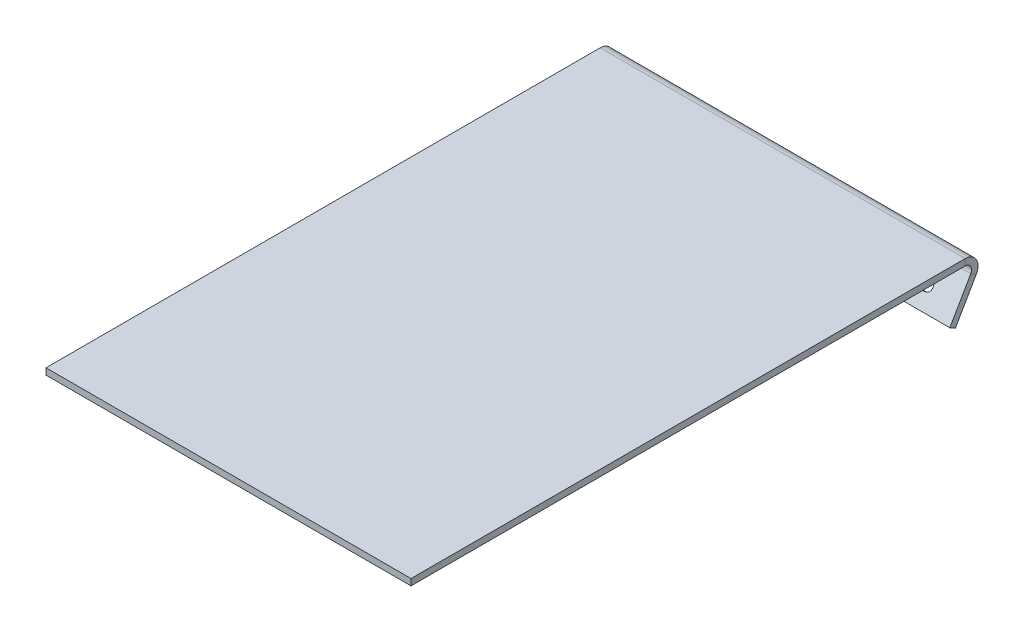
ISO-10303-21;
HEADER;
FILE_DESCRIPTION(('STEP AP214'),'2;1');
FILE_NAME('part.step','',(''),(''),'','','');
FILE_SCHEMA(('AUTOMOTIVE_DESIGN { 1 0 10303 214 1 1 1 1 }'));
ENDSEC;
DATA;
#1=APPLICATION_CONTEXT('core data for automotive mechanical design processes');
#2=APPLICATION_PROTOCOL_DEFINITION('international standard','automotive_design',2000,#1);
#3=PRODUCT_CONTEXT('',#1,'mechanical');
#4=PRODUCT('Part','Part','',(#3));
#5=PRODUCT_RELATED_PRODUCT_CATEGORY('part','',(#4));
#6=PRODUCT_DEFINITION_FORMATION('','',#4);
#7=PRODUCT_DEFINITION_CONTEXT('part definition',#1,'design');
#8=PRODUCT_DEFINITION('design','',#6,#7);
#9=PRODUCT_DEFINITION_SHAPE('','',#8);
#10=(LENGTH_UNIT() NAMED_UNIT(*) SI_UNIT(.MILLI.,.METRE.));
#11=(NAMED_UNIT(*) PLANE_ANGLE_UNIT() SI_UNIT($,.RADIAN.));
#12=(NAMED_UNIT(*) SI_UNIT($,.STERADIAN.) SOLID_ANGLE_UNIT());
#13=UNCERTAINTY_MEASURE_WITH_UNIT(LENGTH_MEASURE(1.E-05),#10,'distance_accuracy_value','');
#14=(GEOMETRIC_REPRESENTATION_CONTEXT(3) GLOBAL_UNCERTAINTY_ASSIGNED_CONTEXT((#13)) GLOBAL_UNIT_ASSIGNED_CONTEXT((#10,
#11,#12)) REPRESENTATION_CONTEXT('',''));
#15=CARTESIAN_POINT('',(0.,0.,0.));
#16=DIRECTION('',(0.,0.,1.));
#17=DIRECTION('',(1.,0.,0.));
#18=AXIS2_PLACEMENT_3D('',#15,#16,#17);
#19=CARTESIAN_POINT('',(57.,1.00000000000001,-178.267949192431));
#20=DIRECTION('',(0.,-0.500000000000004,-0.866025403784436));
#21=DIRECTION('',(0.,0.866025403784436,-0.500000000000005));
#22=AXIS2_PLACEMENT_3D('',#19,#20,#21);
#23=PLANE('',#22);
#24=CARTESIAN_POINT('',(-47.,-11.1243556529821,-171.267949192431));
#25=DIRECTION('',(0.,-0.500000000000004,-0.866025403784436));
#26=DIRECTION('',(0.,0.866025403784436,-0.500000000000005));
#27=AXIS2_PLACEMENT_3D('',#24,#25,#26);
#28=CIRCLE('',#27,1.69999999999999);
#29=CARTESIAN_POINT('',(-47.,-9.65211246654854,-172.117949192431));
#30=VERTEX_POINT('',#29);
#31=EDGE_CURVE('E142',#30,#30,#28,.F.);
#32=ORIENTED_EDGE('',*,*,#31,.F.);
#33=EDGE_LOOP('',(#32));
#34=FACE_BOUND('',#33,.T.);
#35=DIRECTION('',(0.,-0.866025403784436,0.500000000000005));
#36=VECTOR('',#35,1.);
#37=CARTESIAN_POINT('',(-57.,1.00000000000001,-178.267949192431));
#38=LINE('',#37,#36);
#39=CARTESIAN_POINT('',(-57.,-5.00000000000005,-174.803847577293));
#40=VERTEX_POINT('',#39);
#41=CARTESIAN_POINT('',(-57.,-16.3205080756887,-168.267949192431));
#42=VERTEX_POINT('',#41);
#43=EDGE_CURVE('E138',#40,#42,#38,.T.);
#44=ORIENTED_EDGE('',*,*,#43,.T.);
#45=DIRECTION('',(-1.,0.,0.));
#46=VECTOR('',#45,1.);
#47=CARTESIAN_POINT('',(57.,-16.3205080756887,-168.267949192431));
#48=LINE('',#47,#46);
#49=CARTESIAN_POINT('',(57.,-16.3205080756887,-168.267949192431));
#50=VERTEX_POINT('',#49);
#51=EDGE_CURVE('E169',#50,#42,#48,.T.);
#52=ORIENTED_EDGE('',*,*,#51,.F.);
#53=DIRECTION('',(0.,-0.866025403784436,0.500000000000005));
#54=VECTOR('',#53,1.);
#55=CARTESIAN_POINT('',(57.,1.00000000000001,-178.267949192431));
#56=LINE('',#55,#54);
#57=CARTESIAN_POINT('',(57.,-5.00000000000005,-174.803847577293));
#58=VERTEX_POINT('',#57);
#59=EDGE_CURVE('E91',#58,#50,#56,.T.);
#60=ORIENTED_EDGE('',*,*,#59,.F.);
#61=DIRECTION('',(-1.,0.,0.));
#62=VECTOR('',#61,1.);
#63=CARTESIAN_POINT('',(57.,-5.00000000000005,-174.803847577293));
#64=LINE('',#63,#62);
#65=EDGE_CURVE('E137',#58,#40,#64,.T.);
#66=ORIENTED_EDGE('',*,*,#65,.T.);
#67=EDGE_LOOP('',(#44,#52,#60,#66));
#68=FACE_BOUND('',#67,.T.);
#69=CARTESIAN_POINT('',(47.,-11.1243556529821,-171.267949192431));
#70=DIRECTION('',(0.,-0.500000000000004,-0.866025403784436));
#71=DIRECTION('',(0.,0.866025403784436,-0.500000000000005));
#72=AXIS2_PLACEMENT_3D('',#69,#70,#71);
#73=CIRCLE('',#72,1.69999999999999);
#74=CARTESIAN_POINT('',(47.,-9.65211246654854,-172.117949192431));
#75=VERTEX_POINT('',#74);
#76=EDGE_CURVE('E255',#75,#75,#73,.F.);
#77=ORIENTED_EDGE('',*,*,#76,.F.);
#78=EDGE_LOOP('',(#77));
#79=FACE_BOUND('',#78,.T.);
#80=ADVANCED_FACE('F34',(#34,#68,#79),#23,.F.);
#81=CARTESIAN_POINT('',(57.,-6.00000000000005,-176.535898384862));
#82=DIRECTION('',(1.,0.,0.));
#83=DIRECTION('',(0.,0.,-1.));
#84=AXIS2_PLACEMENT_3D('',#81,#82,#83);
#85=PLANE('',#84);
#86=DIRECTION('',(0.,0.5,0.866025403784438));
#87=VECTOR('',#86,1.);
#88=CARTESIAN_POINT('',(57.,-6.00000000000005,-176.535898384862));
#89=LINE('',#88,#87);
#90=CARTESIAN_POINT('',(57.,-6.00000000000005,-176.535898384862));
#91=VERTEX_POINT('',#90);
#92=EDGE_CURVE('E11',#91,#58,#89,.T.);
#93=ORIENTED_EDGE('',*,*,#92,.F.);
#94=CARTESIAN_POINT('',(57.,-4.00000000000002,-173.071796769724));
#95=DIRECTION('',(1.,0.,0.));
#96=DIRECTION('',(0.,0.,-1.));
#97=AXIS2_PLACEMENT_3D('',#94,#95,#96);
#98=CIRCLE('',#97,4.);
#99=CARTESIAN_POINT('',(57.,0.,-173.071796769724));
#100=VERTEX_POINT('',#99);
#101=EDGE_CURVE('E132',#100,#91,#98,.F.);
#102=ORIENTED_EDGE('',*,*,#101,.F.);
#103=DIRECTION('',(0.,1.,0.));
#104=VECTOR('',#103,1.);
#105=CARTESIAN_POINT('',(57.,-2.00000000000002,-173.071796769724));
#106=LINE('',#105,#104);
#107=CARTESIAN_POINT('',(57.,-2.00000000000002,-173.071796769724));
#108=VERTEX_POINT('',#107);
#109=EDGE_CURVE('E43',#108,#100,#106,.T.);
#110=ORIENTED_EDGE('',*,*,#109,.F.);
#111=CARTESIAN_POINT('',(57.,-4.00000000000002,-173.071796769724));
#112=DIRECTION('',(1.,0.,0.));
#113=DIRECTION('',(0.,0.,-1.));
#114=AXIS2_PLACEMENT_3D('',#111,#112,#113);
#115=CIRCLE('',#114,2.);
#116=EDGE_CURVE('E125',#108,#58,#115,.F.);
#117=ORIENTED_EDGE('',*,*,#116,.T.);
#118=EDGE_LOOP('',(#93,#102,#110,#117));
#119=FACE_BOUND('',#118,.T.);
#120=ADVANCED_FACE('F36',(#119),#85,.T.);
#121=CARTESIAN_POINT('',(57.,-2.00000000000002,-173.071796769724));
#122=DIRECTION('',(1.,0.,0.));
#123=DIRECTION('',(0.,0.,-1.));
#124=AXIS2_PLACEMENT_3D('',#121,#122,#123);
#125=PLANE('',#124);
#126=DIRECTION('',(0.,-0.866025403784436,0.500000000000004));
#127=VECTOR('',#126,1.);
#128=CARTESIAN_POINT('',(57.,0.,-180.));
#129=LINE('',#128,#127);
#130=CARTESIAN_POINT('',(57.,-17.3205080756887,-170.));
#131=VERTEX_POINT('',#130);
#132=EDGE_CURVE('E182',#91,#131,#129,.T.);
#133=ORIENTED_EDGE('',*,*,#132,.F.);
#134=ORIENTED_EDGE('',*,*,#92,.T.);
#135=ORIENTED_EDGE('',*,*,#59,.T.);
#136=DIRECTION('',(0.,0.499999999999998,0.866025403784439));
#137=VECTOR('',#136,1.);
#138=CARTESIAN_POINT('',(57.,-17.3205080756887,-170.));
#139=LINE('',#138,#137);
#140=EDGE_CURVE('E268',#131,#50,#139,.T.);
#141=ORIENTED_EDGE('',*,*,#140,.F.);
#142=EDGE_LOOP('',(#133,#134,#135,#141));
#143=FACE_BOUND('',#142,.T.);
#144=ADVANCED_FACE('F190',(#143),#125,.T.);
#145=CARTESIAN_POINT('',(-57.,0.,-173.071796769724));
#146=DIRECTION('',(-1.,0.,0.));
#147=DIRECTION('',(0.,0.,1.));
#148=AXIS2_PLACEMENT_3D('',#145,#146,#147);
#149=PLANE('',#148);
#150=DIRECTION('',(0.,-1.,0.));
#151=VECTOR('',#150,1.);
#152=CARTESIAN_POINT('',(-57.,0.,-173.071796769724));
#153=LINE('',#152,#151);
#154=CARTESIAN_POINT('',(-57.,0.,-173.071796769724));
#155=VERTEX_POINT('',#154);
#156=CARTESIAN_POINT('',(-57.,-2.00000000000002,-173.071796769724));
#157=VERTEX_POINT('',#156);
#158=EDGE_CURVE('E78',#155,#157,#153,.T.);
#159=ORIENTED_EDGE('',*,*,#158,.F.);
#160=CARTESIAN_POINT('',(-57.,-4.00000000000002,-173.071796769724));
#161=DIRECTION('',(1.,0.,0.));
#162=DIRECTION('',(0.,0.,-1.));
#163=AXIS2_PLACEMENT_3D('',#160,#161,#162);
#164=CIRCLE('',#163,4.);
#165=CARTESIAN_POINT('',(-57.,-6.00000000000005,-176.535898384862));
#166=VERTEX_POINT('',#165);
#167=EDGE_CURVE('E148',#155,#166,#164,.F.);
#168=ORIENTED_EDGE('',*,*,#167,.T.);
#169=DIRECTION('',(0.,-0.5,-0.866025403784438));
#170=VECTOR('',#169,1.);
#171=CARTESIAN_POINT('',(-57.,-5.00000000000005,-174.803847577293));
#172=LINE('',#171,#170);
#173=EDGE_CURVE('E85',#40,#166,#172,.T.);
#174=ORIENTED_EDGE('',*,*,#173,.F.);
#175=CARTESIAN_POINT('',(-57.,-4.00000000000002,-173.071796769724));
#176=DIRECTION('',(1.,0.,0.));
#177=DIRECTION('',(0.,0.,-1.));
#178=AXIS2_PLACEMENT_3D('',#175,#176,#177);
#179=CIRCLE('',#178,2.);
#180=EDGE_CURVE('E155',#157,#40,#179,.F.);
#181=ORIENTED_EDGE('',*,*,#180,.F.);
#182=EDGE_LOOP('',(#159,#168,#174,#181));
#183=FACE_BOUND('',#182,.T.);
#184=ADVANCED_FACE('F188',(#183),#149,.T.);
#185=CARTESIAN_POINT('',(-57.,-5.00000000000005,-174.803847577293));
#186=DIRECTION('',(-1.,0.,0.));
#187=DIRECTION('',(0.,0.,1.));
#188=AXIS2_PLACEMENT_3D('',#185,#186,#187);
#189=PLANE('',#188);
#190=DIRECTION('',(0.,0.,-1.));
#191=VECTOR('',#190,1.);
#192=CARTESIAN_POINT('',(-57.,0.,0.));
#193=LINE('',#192,#191);
#194=CARTESIAN_POINT('',(-57.,0.,0.));
#195=VERTEX_POINT('',#194);
#196=EDGE_CURVE('E150',#195,#155,#193,.T.);
#197=ORIENTED_EDGE('',*,*,#196,.T.);
#198=ORIENTED_EDGE('',*,*,#158,.T.);
#199=DIRECTION('',(0.,0.,-1.));
#200=VECTOR('',#199,1.);
#201=CARTESIAN_POINT('',(-57.,-2.,0.));
#202=LINE('',#201,#200);
#203=CARTESIAN_POINT('',(-57.,-2.,0.));
#204=VERTEX_POINT('',#203);
#205=EDGE_CURVE('E153',#204,#157,#202,.T.);
#206=ORIENTED_EDGE('',*,*,#205,.F.);
#207=DIRECTION('',(0.,1.,0.));
#208=VECTOR('',#207,1.);
#209=CARTESIAN_POINT('',(-57.,-2.,0.));
#210=LINE('',#209,#208);
#211=EDGE_CURVE('E113',#204,#195,#210,.T.);
#212=ORIENTED_EDGE('',*,*,#211,.T.);
#213=EDGE_LOOP('',(#197,#198,#206,#212));
#214=FACE_BOUND('',#213,.T.);
#215=ADVANCED_FACE('F184',(#214),#189,.T.);
#216=CARTESIAN_POINT('',(57.,-17.3205080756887,-170.));
#217=DIRECTION('',(0.,-0.866025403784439,0.499999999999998));
#218=DIRECTION('',(0.,-0.499999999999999,-0.86602540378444));
#219=AXIS2_PLACEMENT_3D('',#216,#217,#218);
#220=PLANE('',#219);
#221=DIRECTION('',(0.,0.499999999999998,0.866025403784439));
#222=VECTOR('',#221,1.);
#223=CARTESIAN_POINT('',(-57.,-17.3205080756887,-170.));
#224=LINE('',#223,#222);
#225=CARTESIAN_POINT('',(-57.,-17.3205080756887,-170.));
#226=VERTEX_POINT('',#225);
#227=EDGE_CURVE('E141',#226,#42,#224,.T.);
#228=ORIENTED_EDGE('',*,*,#227,.F.);
#229=DIRECTION('',(-1.,0.,0.));
#230=VECTOR('',#229,1.);
#231=CARTESIAN_POINT('',(57.,-17.3205080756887,-170.));
#232=LINE('',#231,#230);
#233=EDGE_CURVE('E167',#131,#226,#232,.T.);
#234=ORIENTED_EDGE('',*,*,#233,.F.);
#235=ORIENTED_EDGE('',*,*,#140,.T.);
#236=ORIENTED_EDGE('',*,*,#51,.T.);
#237=EDGE_LOOP('',(#228,#234,#235,#236));
#238=FACE_BOUND('',#237,.T.);
#239=ADVANCED_FACE('F196',(#238),#220,.T.);
#240=CARTESIAN_POINT('',(57.,0.,-180.));
#241=DIRECTION('',(0.,-0.500000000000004,-0.866025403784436));
#242=DIRECTION('',(0.,0.866025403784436,-0.500000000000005));
#243=AXIS2_PLACEMENT_3D('',#240,#241,#242);
#244=PLANE('',#243);
#245=CARTESIAN_POINT('',(47.,-12.1243556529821,-173.));
#246=DIRECTION('',(0.,-0.500000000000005,-0.866025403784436));
#247=DIRECTION('',(0.,0.866025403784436,-0.500000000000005));
#248=AXIS2_PLACEMENT_3D('',#245,#246,#247);
#249=CIRCLE('',#248,3.36);
#250=CARTESIAN_POINT('',(47.,-9.21451029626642,-174.68));
#251=VERTEX_POINT('',#250);
#252=EDGE_CURVE('E253',#251,#251,#249,.T.);
#253=ORIENTED_EDGE('',*,*,#252,.F.);
#254=EDGE_LOOP('',(#253));
#255=FACE_BOUND('',#254,.T.);
#256=CARTESIAN_POINT('',(-47.,-12.1243556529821,-173.));
#257=DIRECTION('',(0.,-0.500000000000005,-0.866025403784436));
#258=DIRECTION('',(0.,0.866025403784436,-0.500000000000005));
#259=AXIS2_PLACEMENT_3D('',#256,#257,#258);
#260=CIRCLE('',#259,3.36);
#261=CARTESIAN_POINT('',(-47.,-9.21451029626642,-174.68));
#262=VERTEX_POINT('',#261);
#263=EDGE_CURVE('E262',#262,#262,#260,.T.);
#264=ORIENTED_EDGE('',*,*,#263,.F.);
#265=EDGE_LOOP('',(#264));
#266=FACE_BOUND('',#265,.T.);
#267=DIRECTION('',(0.,-0.866025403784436,0.500000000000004));
#268=VECTOR('',#267,1.);
#269=CARTESIAN_POINT('',(-57.,0.,-180.));
#270=LINE('',#269,#268);
#271=EDGE_CURVE('E145',#166,#226,#270,.T.);
#272=ORIENTED_EDGE('',*,*,#271,.F.);
#273=DIRECTION('',(-1.,0.,0.));
#274=VECTOR('',#273,1.);
#275=CARTESIAN_POINT('',(57.,-6.00000000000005,-176.535898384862));
#276=LINE('',#275,#274);
#277=EDGE_CURVE('E164',#91,#166,#276,.T.);
#278=ORIENTED_EDGE('',*,*,#277,.F.);
#279=ORIENTED_EDGE('',*,*,#132,.T.);
#280=ORIENTED_EDGE('',*,*,#233,.T.);
#281=EDGE_LOOP('',(#272,#278,#279,#280));
#282=FACE_BOUND('',#281,.T.);
#283=ADVANCED_FACE('F209',(#255,#266,#282),#244,.T.);
#284=CARTESIAN_POINT('',(57.,-4.00000000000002,-173.071796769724));
#285=DIRECTION('',(-1.,0.,0.));
#286=DIRECTION('',(0.,0.,1.));
#287=AXIS2_PLACEMENT_3D('',#284,#285,#286);
#288=CYLINDRICAL_SURFACE('',#287,4.);
#289=ORIENTED_EDGE('',*,*,#167,.F.);
#290=DIRECTION('',(-1.,0.,0.));
#291=VECTOR('',#290,1.);
#292=CARTESIAN_POINT('',(57.,0.,-173.071796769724));
#293=LINE('',#292,#291);
#294=EDGE_CURVE('E161',#100,#155,#293,.T.);
#295=ORIENTED_EDGE('',*,*,#294,.F.);
#296=ORIENTED_EDGE('',*,*,#101,.T.);
#297=ORIENTED_EDGE('',*,*,#277,.T.);
#298=EDGE_LOOP('',(#289,#295,#296,#297));
#299=FACE_BOUND('',#298,.T.);
#300=ADVANCED_FACE('F178',(#299),#288,.T.);
#301=CARTESIAN_POINT('',(57.,0.,0.));
#302=DIRECTION('',(0.,1.,0.));
#303=DIRECTION('',(0.,0.,1.));
#304=AXIS2_PLACEMENT_3D('',#301,#302,#303);
#305=PLANE('',#304);
#306=ORIENTED_EDGE('',*,*,#196,.F.);
#307=DIRECTION('',(-1.,0.,0.));
#308=VECTOR('',#307,1.);
#309=CARTESIAN_POINT('',(57.,0.,0.));
#310=LINE('',#309,#308);
#311=CARTESIAN_POINT('',(57.,0.,0.));
#312=VERTEX_POINT('',#311);
#313=EDGE_CURVE('E115',#312,#195,#310,.T.);
#314=ORIENTED_EDGE('',*,*,#313,.F.);
#315=DIRECTION('',(0.,0.,-1.));
#316=VECTOR('',#315,1.);
#317=CARTESIAN_POINT('',(57.,0.,0.));
#318=LINE('',#317,#316);
#319=EDGE_CURVE('E130',#312,#100,#318,.T.);
#320=ORIENTED_EDGE('',*,*,#319,.T.);
#321=ORIENTED_EDGE('',*,*,#294,.T.);
#322=EDGE_LOOP('',(#306,#314,#320,#321));
#323=FACE_BOUND('',#322,.T.);
#324=ADVANCED_FACE('F183',(#323),#305,.T.);
#325=CARTESIAN_POINT('',(57.,-2.,0.));
#326=DIRECTION('',(0.,0.,1.));
#327=DIRECTION('',(1.,0.,0.));
#328=AXIS2_PLACEMENT_3D('',#325,#326,#327);
#329=PLANE('',#328);
#330=ORIENTED_EDGE('',*,*,#211,.F.);
#331=DIRECTION('',(-1.,0.,0.));
#332=VECTOR('',#331,1.);
#333=CARTESIAN_POINT('',(57.,-2.,0.));
#334=LINE('',#333,#332);
#335=CARTESIAN_POINT('',(57.,-2.,0.));
#336=VERTEX_POINT('',#335);
#337=EDGE_CURVE('E107',#336,#204,#334,.T.);
#338=ORIENTED_EDGE('',*,*,#337,.F.);
#339=DIRECTION('',(0.,1.,0.));
#340=VECTOR('',#339,1.);
#341=CARTESIAN_POINT('',(57.,-2.,0.));
#342=LINE('',#341,#340);
#343=EDGE_CURVE('E111',#336,#312,#342,.T.);
#344=ORIENTED_EDGE('',*,*,#343,.T.);
#345=ORIENTED_EDGE('',*,*,#313,.T.);
#346=EDGE_LOOP('',(#330,#338,#344,#345));
#347=FACE_BOUND('',#346,.T.);
#348=ADVANCED_FACE('F109',(#347),#329,.T.);
#349=CARTESIAN_POINT('',(57.,-2.,0.));
#350=DIRECTION('',(0.,1.,0.));
#351=DIRECTION('',(0.,0.,1.));
#352=AXIS2_PLACEMENT_3D('',#349,#350,#351);
#353=PLANE('',#352);
#354=ORIENTED_EDGE('',*,*,#205,.T.);
#355=DIRECTION('',(-1.,0.,0.));
#356=VECTOR('',#355,1.);
#357=CARTESIAN_POINT('',(57.,-2.00000000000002,-173.071796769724));
#358=LINE('',#357,#356);
#359=EDGE_CURVE('E116',#108,#157,#358,.T.);
#360=ORIENTED_EDGE('',*,*,#359,.F.);
#361=DIRECTION('',(0.,0.,-1.));
#362=VECTOR('',#361,1.);
#363=CARTESIAN_POINT('',(57.,-2.,0.));
#364=LINE('',#363,#362);
#365=EDGE_CURVE('E120',#336,#108,#364,.T.);
#366=ORIENTED_EDGE('',*,*,#365,.F.);
#367=ORIENTED_EDGE('',*,*,#337,.T.);
#368=EDGE_LOOP('',(#354,#360,#366,#367));
#369=FACE_BOUND('',#368,.T.);
#370=ADVANCED_FACE('F121',(#369),#353,.F.);
#371=CARTESIAN_POINT('',(57.,-4.00000000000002,-173.071796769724));
#372=DIRECTION('',(-1.,0.,0.));
#373=DIRECTION('',(0.,0.,1.));
#374=AXIS2_PLACEMENT_3D('',#371,#372,#373);
#375=CYLINDRICAL_SURFACE('',#374,2.);
#376=ORIENTED_EDGE('',*,*,#180,.T.);
#377=ORIENTED_EDGE('',*,*,#65,.F.);
#378=ORIENTED_EDGE('',*,*,#116,.F.);
#379=ORIENTED_EDGE('',*,*,#359,.T.);
#380=EDGE_LOOP('',(#376,#377,#378,#379));
#381=FACE_BOUND('',#380,.T.);
#382=ADVANCED_FACE('F186',(#381),#375,.F.);
#383=CARTESIAN_POINT('',(57.,-4.00000000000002,-173.071796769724));
#384=DIRECTION('',(1.,0.,0.));
#385=DIRECTION('',(0.,0.,-1.));
#386=AXIS2_PLACEMENT_3D('',#383,#384,#385);
#387=PLANE('',#386);
#388=ORIENTED_EDGE('',*,*,#365,.T.);
#389=ORIENTED_EDGE('',*,*,#109,.T.);
#390=ORIENTED_EDGE('',*,*,#319,.F.);
#391=ORIENTED_EDGE('',*,*,#343,.F.);
#392=EDGE_LOOP('',(#388,#389,#390,#391));
#393=FACE_BOUND('',#392,.T.);
#394=ADVANCED_FACE('F128',(#393),#387,.T.);
#395=CARTESIAN_POINT('',(-57.,-4.00000000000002,-173.071796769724));
#396=DIRECTION('',(1.,0.,0.));
#397=DIRECTION('',(0.,0.,-1.));
#398=AXIS2_PLACEMENT_3D('',#395,#396,#397);
#399=PLANE('',#398);
#400=ORIENTED_EDGE('',*,*,#43,.F.);
#401=ORIENTED_EDGE('',*,*,#173,.T.);
#402=ORIENTED_EDGE('',*,*,#271,.T.);
#403=ORIENTED_EDGE('',*,*,#227,.T.);
#404=EDGE_LOOP('',(#400,#401,#402,#403));
#405=FACE_BOUND('',#404,.T.);
#406=ADVANCED_FACE('F224',(#405),#399,.F.);
#407=CARTESIAN_POINT('',(-47.,-12.1243556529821,-173.));
#408=DIRECTION('',(0.,-0.500000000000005,-0.866025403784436));
#409=DIRECTION('',(0.,0.866025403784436,-0.500000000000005));
#410=AXIS2_PLACEMENT_3D('',#407,#408,#409);
#411=CYLINDRICAL_SURFACE('',#410,1.69999999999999);
#412=ORIENTED_EDGE('',*,*,#31,.T.);
#413=EDGE_LOOP('',(#412));
#414=FACE_BOUND('',#413,.T.);
#415=CARTESIAN_POINT('',(-47.,-11.2943556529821,-171.562397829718));
#416=DIRECTION('',(0.,-0.500000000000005,-0.866025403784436));
#417=DIRECTION('',(0.,0.866025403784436,-0.500000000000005));
#418=AXIS2_PLACEMENT_3D('',#415,#416,#417);
#419=CIRCLE('',#418,1.69999999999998);
#420=CARTESIAN_POINT('',(-47.,-9.8221124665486,-172.412397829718));
#421=VERTEX_POINT('',#420);
#422=EDGE_CURVE('E261',#421,#421,#419,.T.);
#423=ORIENTED_EDGE('',*,*,#422,.T.);
#424=EDGE_LOOP('',(#423));
#425=FACE_BOUND('',#424,.T.);
#426=ADVANCED_FACE('F227',(#414,#425),#411,.F.);
#427=CARTESIAN_POINT('',(-47.,-12.1243556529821,-173.));
#428=DIRECTION('',(0.,-0.500000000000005,-0.866025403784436));
#429=DIRECTION('',(0.,0.866025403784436,-0.500000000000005));
#430=AXIS2_PLACEMENT_3D('',#427,#428,#429);
#431=CONICAL_SURFACE('',#430,3.36,0.785398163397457);
#432=ORIENTED_EDGE('',*,*,#422,.F.);
#433=EDGE_LOOP('',(#432));
#434=FACE_BOUND('',#433,.T.);
#435=ORIENTED_EDGE('',*,*,#263,.T.);
#436=EDGE_LOOP('',(#435));
#437=FACE_BOUND('',#436,.T.);
#438=ADVANCED_FACE('F233',(#434,#437),#431,.F.);
#439=CARTESIAN_POINT('',(47.,-12.1243556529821,-173.));
#440=DIRECTION('',(0.,-0.500000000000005,-0.866025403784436));
#441=DIRECTION('',(0.,0.866025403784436,-0.500000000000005));
#442=AXIS2_PLACEMENT_3D('',#439,#440,#441);
#443=CYLINDRICAL_SURFACE('',#442,1.69999999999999);
#444=ORIENTED_EDGE('',*,*,#76,.T.);
#445=EDGE_LOOP('',(#444));
#446=FACE_BOUND('',#445,.T.);
#447=CARTESIAN_POINT('',(47.,-11.2943556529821,-171.562397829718));
#448=DIRECTION('',(0.,-0.500000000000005,-0.866025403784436));
#449=DIRECTION('',(0.,0.866025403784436,-0.500000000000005));
#450=AXIS2_PLACEMENT_3D('',#447,#448,#449);
#451=CIRCLE('',#450,1.69999999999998);
#452=CARTESIAN_POINT('',(47.,-9.8221124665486,-172.412397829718));
#453=VERTEX_POINT('',#452);
#454=EDGE_CURVE('E250',#453,#453,#451,.T.);
#455=ORIENTED_EDGE('',*,*,#454,.T.);
#456=EDGE_LOOP('',(#455));
#457=FACE_BOUND('',#456,.T.);
#458=ADVANCED_FACE('F237',(#446,#457),#443,.F.);
#459=CARTESIAN_POINT('',(47.,-12.1243556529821,-173.));
#460=DIRECTION('',(0.,-0.500000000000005,-0.866025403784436));
#461=DIRECTION('',(0.,0.866025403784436,-0.500000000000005));
#462=AXIS2_PLACEMENT_3D('',#459,#460,#461);
#463=CONICAL_SURFACE('',#462,3.36,0.785398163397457);
#464=ORIENTED_EDGE('',*,*,#454,.F.);
#465=EDGE_LOOP('',(#464));
#466=FACE_BOUND('',#465,.T.);
#467=ORIENTED_EDGE('',*,*,#252,.T.);
#468=EDGE_LOOP('',(#467));
#469=FACE_BOUND('',#468,.T.);
#470=ADVANCED_FACE('F241',(#466,#469),#463,.F.);
#471=CLOSED_SHELL('',(#80,#120,#144,#184,#215,#239,#283,#300,#324,#348,#370,#382,#394,#406,#426,
#438,#458,#470));
#472=MANIFOLD_SOLID_BREP('B2',#471);
#473=ADVANCED_BREP_SHAPE_REPRESENTATION('',(#18,#472),#14);
#474=SHAPE_DEFINITION_REPRESENTATION(#9,#473);
ENDSEC;
END-ISO-10303-21;
